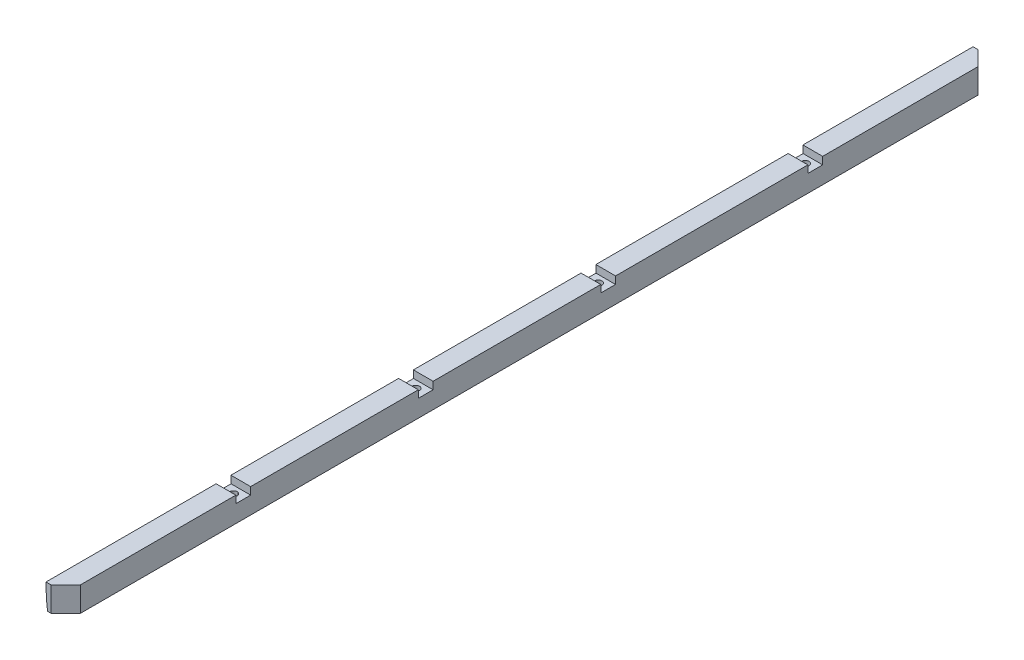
ISO-10303-21;
HEADER;
FILE_DESCRIPTION(('STEP AP214'),'2;1');
FILE_NAME('part.step','',(''),(''),'','','');
FILE_SCHEMA(('AUTOMOTIVE_DESIGN { 1 0 10303 214 1 1 1 1 }'));
ENDSEC;
DATA;
#1=APPLICATION_CONTEXT('core data for automotive mechanical design processes');
#2=APPLICATION_PROTOCOL_DEFINITION('international standard','automotive_design',2000,#1);
#3=PRODUCT_CONTEXT('',#1,'mechanical');
#4=PRODUCT('Part','Part','',(#3));
#5=PRODUCT_RELATED_PRODUCT_CATEGORY('part','',(#4));
#6=PRODUCT_DEFINITION_FORMATION('','',#4);
#7=PRODUCT_DEFINITION_CONTEXT('part definition',#1,'design');
#8=PRODUCT_DEFINITION('design','',#6,#7);
#9=PRODUCT_DEFINITION_SHAPE('','',#8);
#10=(LENGTH_UNIT() NAMED_UNIT(*) SI_UNIT(.MILLI.,.METRE.));
#11=(NAMED_UNIT(*) PLANE_ANGLE_UNIT() SI_UNIT($,.RADIAN.));
#12=(NAMED_UNIT(*) SI_UNIT($,.STERADIAN.) SOLID_ANGLE_UNIT());
#13=UNCERTAINTY_MEASURE_WITH_UNIT(LENGTH_MEASURE(1.E-05),#10,'distance_accuracy_value','');
#14=(GEOMETRIC_REPRESENTATION_CONTEXT(3) GLOBAL_UNCERTAINTY_ASSIGNED_CONTEXT((#13)) GLOBAL_UNIT_ASSIGNED_CONTEXT((#10,
#11,#12)) REPRESENTATION_CONTEXT('',''));
#15=CARTESIAN_POINT('',(0.,0.,0.));
#16=DIRECTION('',(0.,0.,1.));
#17=DIRECTION('',(1.,0.,0.));
#18=AXIS2_PLACEMENT_3D('',#15,#16,#17);
#19=CARTESIAN_POINT('',(234.95,0.,1193.8));
#20=DIRECTION('',(0.,-1.,0.));
#21=DIRECTION('',(0.,0.,-1.));
#22=AXIS2_PLACEMENT_3D('',#19,#20,#21);
#23=PLANE('',#22);
#24=DIRECTION('',(0.,0.,-1.));
#25=VECTOR('',#24,1.);
#26=CARTESIAN_POINT('',(234.95,0.,1193.8));
#27=LINE('',#26,#25);
#28=CARTESIAN_POINT('',(234.95,0.,1174.75));
#29=VERTEX_POINT('',#28);
#30=CARTESIAN_POINT('',(234.95,0.,974.725));
#31=VERTEX_POINT('',#30);
#32=EDGE_CURVE('E212',#29,#31,#27,.T.);
#33=ORIENTED_EDGE('',*,*,#32,.T.);
#34=DIRECTION('',(-1.,0.,0.));
#35=VECTOR('',#34,1.);
#36=CARTESIAN_POINT('',(117.502238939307,0.,974.725));
#37=LINE('',#36,#35);
#38=CARTESIAN_POINT('',(209.55,0.,974.725));
#39=VERTEX_POINT('',#38);
#40=EDGE_CURVE('E271',#31,#39,#37,.T.);
#41=ORIENTED_EDGE('',*,*,#40,.T.);
#42=DIRECTION('',(0.,0.,-1.));
#43=VECTOR('',#42,1.);
#44=CARTESIAN_POINT('',(209.55,0.,1193.8));
#45=LINE('',#44,#43);
#46=CARTESIAN_POINT('',(209.55,0.,1193.8));
#47=VERTEX_POINT('',#46);
#48=EDGE_CURVE('E223',#47,#39,#45,.T.);
#49=ORIENTED_EDGE('',*,*,#48,.F.);
#50=DIRECTION('',(1.,0.,0.));
#51=VECTOR('',#50,1.);
#52=CARTESIAN_POINT('',(234.95,0.,1193.8));
#53=LINE('',#52,#51);
#54=CARTESIAN_POINT('',(215.9,0.,1193.8));
#55=VERTEX_POINT('',#54);
#56=EDGE_CURVE('E208',#47,#55,#53,.T.);
#57=ORIENTED_EDGE('',*,*,#56,.T.);
#58=DIRECTION('',(0.707106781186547,0.,-0.707106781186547));
#59=VECTOR('',#58,1.);
#60=CARTESIAN_POINT('',(215.9,0.,1193.8));
#61=LINE('',#60,#59);
#62=EDGE_CURVE('E339',#55,#29,#61,.T.);
#63=ORIENTED_EDGE('',*,*,#62,.T.);
#64=EDGE_LOOP('',(#33,#41,#49,#57,#63));
#65=FACE_BOUND('',#64,.T.);
#66=ADVANCED_FACE('F37',(#65),#23,.F.);
#67=CARTESIAN_POINT('',(234.95,0.,955.675));
#68=VERTEX_POINT('',#67);
#69=CARTESIAN_POINT('',(234.95,0.,739.775));
#70=VERTEX_POINT('',#69);
#71=EDGE_CURVE('E222',#68,#70,#27,.T.);
#72=ORIENTED_EDGE('',*,*,#71,.T.);
#73=DIRECTION('',(-1.,0.,0.));
#74=VECTOR('',#73,1.);
#75=CARTESIAN_POINT('',(117.502238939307,0.,739.775));
#76=LINE('',#75,#74);
#77=CARTESIAN_POINT('',(209.55,0.,739.775));
#78=VERTEX_POINT('',#77);
#79=EDGE_CURVE('E363',#70,#78,#76,.T.);
#80=ORIENTED_EDGE('',*,*,#79,.T.);
#81=CARTESIAN_POINT('',(209.55,0.,955.675));
#82=VERTEX_POINT('',#81);
#83=EDGE_CURVE('E227',#82,#78,#45,.T.);
#84=ORIENTED_EDGE('',*,*,#83,.F.);
#85=DIRECTION('',(1.,0.,0.));
#86=VECTOR('',#85,1.);
#87=CARTESIAN_POINT('',(117.502238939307,0.,955.675));
#88=LINE('',#87,#86);
#89=EDGE_CURVE('E261',#82,#68,#88,.T.);
#90=ORIENTED_EDGE('',*,*,#89,.T.);
#91=EDGE_LOOP('',(#72,#80,#84,#90));
#92=FACE_BOUND('',#91,.T.);
#93=ADVANCED_FACE('F268',(#92),#23,.F.);
#94=CARTESIAN_POINT('',(234.95,0.,720.725));
#95=VERTEX_POINT('',#94);
#96=CARTESIAN_POINT('',(234.95,0.,504.825));
#97=VERTEX_POINT('',#96);
#98=EDGE_CURVE('E275',#95,#97,#27,.T.);
#99=ORIENTED_EDGE('',*,*,#98,.T.);
#100=DIRECTION('',(-1.,0.,0.));
#101=VECTOR('',#100,1.);
#102=CARTESIAN_POINT('',(117.502238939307,0.,504.825));
#103=LINE('',#102,#101);
#104=CARTESIAN_POINT('',(209.55,0.,504.825));
#105=VERTEX_POINT('',#104);
#106=EDGE_CURVE('E378',#97,#105,#103,.T.);
#107=ORIENTED_EDGE('',*,*,#106,.T.);
#108=CARTESIAN_POINT('',(209.55,0.,720.725));
#109=VERTEX_POINT('',#108);
#110=EDGE_CURVE('E395',#109,#105,#45,.T.);
#111=ORIENTED_EDGE('',*,*,#110,.F.);
#112=DIRECTION('',(1.,0.,0.));
#113=VECTOR('',#112,1.);
#114=CARTESIAN_POINT('',(117.502238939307,0.,720.725));
#115=LINE('',#114,#113);
#116=EDGE_CURVE('E359',#109,#95,#115,.T.);
#117=ORIENTED_EDGE('',*,*,#116,.T.);
#118=EDGE_LOOP('',(#99,#107,#111,#117));
#119=FACE_BOUND('',#118,.T.);
#120=ADVANCED_FACE('F417',(#119),#23,.F.);
#121=CARTESIAN_POINT('',(234.95,0.,485.775));
#122=VERTEX_POINT('',#121);
#123=CARTESIAN_POINT('',(234.95,0.,238.125));
#124=VERTEX_POINT('',#123);
#125=EDGE_CURVE('E210',#122,#124,#27,.T.);
#126=ORIENTED_EDGE('',*,*,#125,.T.);
#127=DIRECTION('',(-1.,0.,0.));
#128=VECTOR('',#127,1.);
#129=CARTESIAN_POINT('',(117.502238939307,0.,238.125));
#130=LINE('',#129,#128);
#131=CARTESIAN_POINT('',(209.55,0.,238.125));
#132=VERTEX_POINT('',#131);
#133=EDGE_CURVE('E289',#124,#132,#130,.T.);
#134=ORIENTED_EDGE('',*,*,#133,.T.);
#135=CARTESIAN_POINT('',(209.55,0.,485.775));
#136=VERTEX_POINT('',#135);
#137=EDGE_CURVE('E393',#136,#132,#45,.T.);
#138=ORIENTED_EDGE('',*,*,#137,.F.);
#139=DIRECTION('',(1.,0.,0.));
#140=VECTOR('',#139,1.);
#141=CARTESIAN_POINT('',(117.502238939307,0.,485.775));
#142=LINE('',#141,#140);
#143=EDGE_CURVE('E291',#136,#122,#142,.T.);
#144=ORIENTED_EDGE('',*,*,#143,.T.);
#145=EDGE_LOOP('',(#126,#134,#138,#144));
#146=FACE_BOUND('',#145,.T.);
#147=ADVANCED_FACE('F286',(#146),#23,.F.);
#148=CARTESIAN_POINT('',(234.95,-31.75,1193.8));
#149=DIRECTION('',(0.,1.,0.));
#150=DIRECTION('',(1.,0.,0.));
#151=AXIS2_PLACEMENT_3D('',#148,#149,#150);
#152=PLANE('',#151);
#153=CARTESIAN_POINT('',(222.25,-31.7500000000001,228.6));
#154=DIRECTION('',(0.,-1.,0.));
#155=DIRECTION('',(0.,0.,1.));
#156=AXIS2_PLACEMENT_3D('',#153,#154,#155);
#157=CIRCLE('',#156,4.76250000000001);
#158=CARTESIAN_POINT('',(222.25,-31.7500000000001,233.3625));
#159=VERTEX_POINT('',#158);
#160=EDGE_CURVE('E646',#159,#159,#157,.T.);
#161=ORIENTED_EDGE('',*,*,#160,.F.);
#162=EDGE_LOOP('',(#161));
#163=FACE_BOUND('',#162,.T.);
#164=CARTESIAN_POINT('',(222.25,-31.7500000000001,495.3));
#165=DIRECTION('',(0.,-1.,0.));
#166=DIRECTION('',(0.,0.,1.));
#167=AXIS2_PLACEMENT_3D('',#164,#165,#166);
#168=CIRCLE('',#167,4.76250000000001);
#169=CARTESIAN_POINT('',(222.25,-31.7500000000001,500.0625));
#170=VERTEX_POINT('',#169);
#171=EDGE_CURVE('E654',#170,#170,#168,.T.);
#172=ORIENTED_EDGE('',*,*,#171,.F.);
#173=EDGE_LOOP('',(#172));
#174=FACE_BOUND('',#173,.T.);
#175=CARTESIAN_POINT('',(222.25,-31.7500000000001,730.25));
#176=DIRECTION('',(0.,-1.,0.));
#177=DIRECTION('',(0.,0.,1.));
#178=AXIS2_PLACEMENT_3D('',#175,#176,#177);
#179=CIRCLE('',#178,4.76250000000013);
#180=CARTESIAN_POINT('',(222.25,-31.7500000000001,735.0125));
#181=VERTEX_POINT('',#180);
#182=EDGE_CURVE('E660',#181,#181,#179,.T.);
#183=ORIENTED_EDGE('',*,*,#182,.F.);
#184=EDGE_LOOP('',(#183));
#185=FACE_BOUND('',#184,.T.);
#186=CARTESIAN_POINT('',(222.424296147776,-31.7500000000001,965.2));
#187=DIRECTION('',(0.,-1.,0.));
#188=DIRECTION('',(0.,0.,1.));
#189=AXIS2_PLACEMENT_3D('',#186,#187,#188);
#190=CIRCLE('',#189,4.76250000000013);
#191=CARTESIAN_POINT('',(222.424296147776,-31.7500000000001,969.9625));
#192=VERTEX_POINT('',#191);
#193=EDGE_CURVE('E332',#192,#192,#190,.T.);
#194=ORIENTED_EDGE('',*,*,#193,.F.);
#195=EDGE_LOOP('',(#194));
#196=FACE_BOUND('',#195,.T.);
#197=DIRECTION('',(0.,0.,-1.));
#198=VECTOR('',#197,1.);
#199=CARTESIAN_POINT('',(234.95,-31.75,1193.8));
#200=LINE('',#199,#198);
#201=CARTESIAN_POINT('',(234.95,-31.7500000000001,1174.75));
#202=VERTEX_POINT('',#201);
#203=CARTESIAN_POINT('',(234.95,-31.7500000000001,19.05));
#204=VERTEX_POINT('',#203);
#205=EDGE_CURVE('E199',#202,#204,#200,.T.);
#206=ORIENTED_EDGE('',*,*,#205,.F.);
#207=DIRECTION('',(0.707106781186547,0.,-0.707106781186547));
#208=VECTOR('',#207,1.);
#209=CARTESIAN_POINT('',(215.9,-31.7500000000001,1193.8));
#210=LINE('',#209,#208);
#211=CARTESIAN_POINT('',(215.9,-31.75,1193.8));
#212=VERTEX_POINT('',#211);
#213=EDGE_CURVE('E341',#212,#202,#210,.T.);
#214=ORIENTED_EDGE('',*,*,#213,.F.);
#215=DIRECTION('',(-1.,0.,0.));
#216=VECTOR('',#215,1.);
#217=CARTESIAN_POINT('',(234.95,-31.75,1193.8));
#218=LINE('',#217,#216);
#219=CARTESIAN_POINT('',(211.493227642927,-31.7500000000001,1193.8));
#220=VERTEX_POINT('',#219);
#221=EDGE_CURVE('E318',#212,#220,#218,.T.);
#222=ORIENTED_EDGE('',*,*,#221,.T.);
#223=DIRECTION('',(0.,0.,-1.));
#224=VECTOR('',#223,1.);
#225=CARTESIAN_POINT('',(211.493227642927,-31.7500000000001,1193.8));
#226=LINE('',#225,#224);
#227=CARTESIAN_POINT('',(211.493227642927,-31.7500000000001,0.));
#228=VERTEX_POINT('',#227);
#229=EDGE_CURVE('E226',#220,#228,#226,.T.);
#230=ORIENTED_EDGE('',*,*,#229,.T.);
#231=DIRECTION('',(-1.,0.,0.));
#232=VECTOR('',#231,1.);
#233=CARTESIAN_POINT('',(234.95,-31.75,0.));
#234=LINE('',#233,#232);
#235=CARTESIAN_POINT('',(215.9,-31.7500000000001,0.));
#236=VERTEX_POINT('',#235);
#237=EDGE_CURVE('E202',#236,#228,#234,.T.);
#238=ORIENTED_EDGE('',*,*,#237,.F.);
#239=DIRECTION('',(-0.707106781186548,0.,-0.707106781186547));
#240=VECTOR('',#239,1.);
#241=CARTESIAN_POINT('',(215.9,-31.7500000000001,0.));
#242=LINE('',#241,#240);
#243=EDGE_CURVE('E188',#204,#236,#242,.T.);
#244=ORIENTED_EDGE('',*,*,#243,.F.);
#245=EDGE_LOOP('',(#206,#214,#222,#230,#238,#244));
#246=FACE_BOUND('',#245,.T.);
#247=ADVANCED_FACE('F39',(#163,#174,#185,#196,#246),#152,.F.);
#248=CARTESIAN_POINT('',(469.9,0.,1193.8));
#249=DIRECTION('',(0.,0.,-1.));
#250=DIRECTION('',(1.,0.,0.));
#251=AXIS2_PLACEMENT_3D('',#248,#249,#250);
#252=CYLINDRICAL_SURFACE('',#251,260.35);
#253=DIRECTION('',(0.,0.,-1.));
#254=VECTOR('',#253,1.);
#255=CARTESIAN_POINT('',(209.724296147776,-9.525,1193.8));
#256=LINE('',#255,#254);
#257=CARTESIAN_POINT('',(209.724296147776,-9.525,974.725));
#258=VERTEX_POINT('',#257);
#259=CARTESIAN_POINT('',(209.724296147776,-9.525,955.675));
#260=VERTEX_POINT('',#259);
#261=EDGE_CURVE('E349',#258,#260,#256,.T.);
#262=ORIENTED_EDGE('',*,*,#261,.T.);
#263=CARTESIAN_POINT('',(469.9,0.,955.675));
#264=DIRECTION('',(0.,0.,1.));
#265=DIRECTION('',(1.,0.,0.));
#266=AXIS2_PLACEMENT_3D('',#263,#264,#265);
#267=CIRCLE('',#266,260.35);
#268=EDGE_CURVE('E355',#82,#260,#267,.T.);
#269=ORIENTED_EDGE('',*,*,#268,.F.);
#270=ORIENTED_EDGE('',*,*,#83,.T.);
#271=CARTESIAN_POINT('',(469.9,0.,739.775));
#272=DIRECTION('',(0.,0.,-1.));
#273=DIRECTION('',(-1.,0.,0.));
#274=AXIS2_PLACEMENT_3D('',#271,#272,#273);
#275=CIRCLE('',#274,260.35);
#276=CARTESIAN_POINT('',(209.724296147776,-9.525,739.775));
#277=VERTEX_POINT('',#276);
#278=EDGE_CURVE('E373',#277,#78,#275,.T.);
#279=ORIENTED_EDGE('',*,*,#278,.F.);
#280=DIRECTION('',(0.,0.,-1.));
#281=VECTOR('',#280,1.);
#282=CARTESIAN_POINT('',(209.724296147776,-9.525,1193.8));
#283=LINE('',#282,#281);
#284=CARTESIAN_POINT('',(209.724296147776,-9.525,720.725));
#285=VERTEX_POINT('',#284);
#286=EDGE_CURVE('E365',#285,#277,#283,.F.);
#287=ORIENTED_EDGE('',*,*,#286,.F.);
#288=CARTESIAN_POINT('',(469.9,0.,720.725));
#289=DIRECTION('',(0.,0.,1.));
#290=DIRECTION('',(1.,0.,0.));
#291=AXIS2_PLACEMENT_3D('',#288,#289,#290);
#292=CIRCLE('',#291,260.35);
#293=EDGE_CURVE('E370',#109,#285,#292,.T.);
#294=ORIENTED_EDGE('',*,*,#293,.F.);
#295=ORIENTED_EDGE('',*,*,#110,.T.);
#296=CARTESIAN_POINT('',(469.9,0.,504.825));
#297=DIRECTION('',(0.,0.,-1.));
#298=DIRECTION('',(-1.,0.,0.));
#299=AXIS2_PLACEMENT_3D('',#296,#297,#298);
#300=CIRCLE('',#299,260.35);
#301=CARTESIAN_POINT('',(209.724296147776,-9.525,504.825));
#302=VERTEX_POINT('',#301);
#303=EDGE_CURVE('E307',#302,#105,#300,.T.);
#304=ORIENTED_EDGE('',*,*,#303,.F.);
#305=DIRECTION('',(0.,0.,-1.));
#306=VECTOR('',#305,1.);
#307=CARTESIAN_POINT('',(209.724296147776,-9.525,1193.8));
#308=LINE('',#307,#306);
#309=CARTESIAN_POINT('',(209.724296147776,-9.525,485.775));
#310=VERTEX_POINT('',#309);
#311=EDGE_CURVE('E380',#310,#302,#308,.F.);
#312=ORIENTED_EDGE('',*,*,#311,.F.);
#313=CARTESIAN_POINT('',(469.9,0.,485.775));
#314=DIRECTION('',(0.,0.,1.));
#315=DIRECTION('',(1.,0.,0.));
#316=AXIS2_PLACEMENT_3D('',#313,#314,#315);
#317=CIRCLE('',#316,260.35);
#318=EDGE_CURVE('E385',#136,#310,#317,.T.);
#319=ORIENTED_EDGE('',*,*,#318,.F.);
#320=ORIENTED_EDGE('',*,*,#137,.T.);
#321=CARTESIAN_POINT('',(469.9,0.,238.125));
#322=DIRECTION('',(0.,0.,-1.));
#323=DIRECTION('',(-1.,0.,0.));
#324=AXIS2_PLACEMENT_3D('',#321,#322,#323);
#325=CIRCLE('',#324,260.35);
#326=CARTESIAN_POINT('',(209.724296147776,-9.525,238.125));
#327=VERTEX_POINT('',#326);
#328=EDGE_CURVE('E299',#327,#132,#325,.T.);
#329=ORIENTED_EDGE('',*,*,#328,.F.);
#330=DIRECTION('',(0.,0.,-1.));
#331=VECTOR('',#330,1.);
#332=CARTESIAN_POINT('',(209.724296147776,-9.525,1193.8));
#333=LINE('',#332,#331);
#334=CARTESIAN_POINT('',(209.724296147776,-9.525,219.075));
#335=VERTEX_POINT('',#334);
#336=EDGE_CURVE('E311',#335,#327,#333,.F.);
#337=ORIENTED_EDGE('',*,*,#336,.F.);
#338=CARTESIAN_POINT('',(469.9,0.,219.075));
#339=DIRECTION('',(0.,0.,1.));
#340=DIRECTION('',(1.,0.,0.));
#341=AXIS2_PLACEMENT_3D('',#338,#339,#340);
#342=CIRCLE('',#341,260.35);
#343=CARTESIAN_POINT('',(209.55,0.,219.075));
#344=VERTEX_POINT('',#343);
#345=EDGE_CURVE('E314',#344,#335,#342,.T.);
#346=ORIENTED_EDGE('',*,*,#345,.F.);
#347=CARTESIAN_POINT('',(209.55,0.,0.));
#348=VERTEX_POINT('',#347);
#349=EDGE_CURVE('E221',#344,#348,#45,.T.);
#350=ORIENTED_EDGE('',*,*,#349,.T.);
#351=CARTESIAN_POINT('',(469.9,0.,0.));
#352=DIRECTION('',(0.,0.,-1.));
#353=DIRECTION('',(-1.,0.,0.));
#354=AXIS2_PLACEMENT_3D('',#351,#352,#353);
#355=CIRCLE('',#354,260.35);
#356=EDGE_CURVE('E322',#228,#348,#355,.T.);
#357=ORIENTED_EDGE('',*,*,#356,.F.);
#358=ORIENTED_EDGE('',*,*,#229,.F.);
#359=CARTESIAN_POINT('',(469.9,0.,1193.8));
#360=DIRECTION('',(0.,0.,-1.));
#361=DIRECTION('',(-1.,0.,0.));
#362=AXIS2_PLACEMENT_3D('',#359,#360,#361);
#363=CIRCLE('',#362,260.35);
#364=EDGE_CURVE('E214',#220,#47,#363,.T.);
#365=ORIENTED_EDGE('',*,*,#364,.T.);
#366=ORIENTED_EDGE('',*,*,#48,.T.);
#367=CARTESIAN_POINT('',(469.9,0.,974.725));
#368=DIRECTION('',(0.,0.,-1.));
#369=DIRECTION('',(-1.,0.,0.));
#370=AXIS2_PLACEMENT_3D('',#367,#368,#369);
#371=CIRCLE('',#370,260.35);
#372=EDGE_CURVE('E357',#258,#39,#371,.T.);
#373=ORIENTED_EDGE('',*,*,#372,.F.);
#374=EDGE_LOOP('',(#262,#269,#270,#279,#287,#294,#295,#304,#312,#319,#320,#329,#337,#346,#350,
#357,#358,#365,#366,#373));
#375=FACE_BOUND('',#374,.T.);
#376=ADVANCED_FACE('F392',(#375),#252,.T.);
#377=DIRECTION('',(1.,0.,0.));
#378=VECTOR('',#377,1.);
#379=CARTESIAN_POINT('',(234.95,0.,0.));
#380=LINE('',#379,#378);
#381=CARTESIAN_POINT('',(215.9,0.,0.));
#382=VERTEX_POINT('',#381);
#383=EDGE_CURVE('E217',#348,#382,#380,.T.);
#384=ORIENTED_EDGE('',*,*,#383,.F.);
#385=ORIENTED_EDGE('',*,*,#349,.F.);
#386=DIRECTION('',(1.,0.,0.));
#387=VECTOR('',#386,1.);
#388=CARTESIAN_POINT('',(117.502238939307,0.,219.075));
#389=LINE('',#388,#387);
#390=CARTESIAN_POINT('',(234.95,0.,219.075));
#391=VERTEX_POINT('',#390);
#392=EDGE_CURVE('E302',#344,#391,#389,.T.);
#393=ORIENTED_EDGE('',*,*,#392,.T.);
#394=CARTESIAN_POINT('',(234.95,0.,19.05));
#395=VERTEX_POINT('',#394);
#396=EDGE_CURVE('E207',#391,#395,#27,.T.);
#397=ORIENTED_EDGE('',*,*,#396,.T.);
#398=DIRECTION('',(-0.707106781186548,0.,-0.707106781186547));
#399=VECTOR('',#398,1.);
#400=CARTESIAN_POINT('',(215.9,0.,0.));
#401=LINE('',#400,#399);
#402=EDGE_CURVE('E190',#395,#382,#401,.T.);
#403=ORIENTED_EDGE('',*,*,#402,.T.);
#404=EDGE_LOOP('',(#384,#385,#393,#397,#403));
#405=FACE_BOUND('',#404,.T.);
#406=ADVANCED_FACE('F330',(#405),#23,.F.);
#407=CARTESIAN_POINT('',(234.95,0.,1193.8));
#408=DIRECTION('',(-1.,0.,0.));
#409=DIRECTION('',(0.,0.,-1.));
#410=AXIS2_PLACEMENT_3D('',#407,#408,#409);
#411=PLANE('',#410);
#412=ORIENTED_EDGE('',*,*,#396,.F.);
#413=DIRECTION('',(0.,1.,0.));
#414=VECTOR('',#413,1.);
#415=CARTESIAN_POINT('',(234.95,0.,219.075));
#416=LINE('',#415,#414);
#417=CARTESIAN_POINT('',(234.95,-9.525,219.075));
#418=VERTEX_POINT('',#417);
#419=EDGE_CURVE('E232',#418,#391,#416,.T.);
#420=ORIENTED_EDGE('',*,*,#419,.F.);
#421=DIRECTION('',(0.,0.,-1.));
#422=VECTOR('',#421,1.);
#423=CARTESIAN_POINT('',(234.95,-9.525,1193.8));
#424=LINE('',#423,#422);
#425=CARTESIAN_POINT('',(234.95,-9.525,238.125));
#426=VERTEX_POINT('',#425);
#427=EDGE_CURVE('E229',#426,#418,#424,.T.);
#428=ORIENTED_EDGE('',*,*,#427,.F.);
#429=DIRECTION('',(0.,-1.,0.));
#430=VECTOR('',#429,1.);
#431=CARTESIAN_POINT('',(234.95,0.,238.125));
#432=LINE('',#431,#430);
#433=EDGE_CURVE('E234',#124,#426,#432,.T.);
#434=ORIENTED_EDGE('',*,*,#433,.F.);
#435=ORIENTED_EDGE('',*,*,#125,.F.);
#436=DIRECTION('',(0.,1.,0.));
#437=VECTOR('',#436,1.);
#438=CARTESIAN_POINT('',(234.95,0.,485.775));
#439=LINE('',#438,#437);
#440=CARTESIAN_POINT('',(234.95,-9.525,485.775));
#441=VERTEX_POINT('',#440);
#442=EDGE_CURVE('E240',#441,#122,#439,.T.);
#443=ORIENTED_EDGE('',*,*,#442,.F.);
#444=DIRECTION('',(0.,0.,-1.));
#445=VECTOR('',#444,1.);
#446=CARTESIAN_POINT('',(234.95,-9.525,1193.8));
#447=LINE('',#446,#445);
#448=CARTESIAN_POINT('',(234.95,-9.525,504.825));
#449=VERTEX_POINT('',#448);
#450=EDGE_CURVE('E237',#449,#441,#447,.T.);
#451=ORIENTED_EDGE('',*,*,#450,.F.);
#452=DIRECTION('',(0.,-1.,0.));
#453=VECTOR('',#452,1.);
#454=CARTESIAN_POINT('',(234.95,0.,504.825));
#455=LINE('',#454,#453);
#456=EDGE_CURVE('E242',#97,#449,#455,.T.);
#457=ORIENTED_EDGE('',*,*,#456,.F.);
#458=ORIENTED_EDGE('',*,*,#98,.F.);
#459=DIRECTION('',(0.,1.,0.));
#460=VECTOR('',#459,1.);
#461=CARTESIAN_POINT('',(234.95,0.,720.725));
#462=LINE('',#461,#460);
#463=CARTESIAN_POINT('',(234.95,-9.525,720.725));
#464=VERTEX_POINT('',#463);
#465=EDGE_CURVE('E248',#464,#95,#462,.T.);
#466=ORIENTED_EDGE('',*,*,#465,.F.);
#467=DIRECTION('',(0.,0.,-1.));
#468=VECTOR('',#467,1.);
#469=CARTESIAN_POINT('',(234.95,-9.525,1193.8));
#470=LINE('',#469,#468);
#471=CARTESIAN_POINT('',(234.95,-9.525,739.775));
#472=VERTEX_POINT('',#471);
#473=EDGE_CURVE('E245',#472,#464,#470,.T.);
#474=ORIENTED_EDGE('',*,*,#473,.F.);
#475=DIRECTION('',(0.,-1.,0.));
#476=VECTOR('',#475,1.);
#477=CARTESIAN_POINT('',(234.95,0.,739.775));
#478=LINE('',#477,#476);
#479=EDGE_CURVE('E250',#70,#472,#478,.T.);
#480=ORIENTED_EDGE('',*,*,#479,.F.);
#481=ORIENTED_EDGE('',*,*,#71,.F.);
#482=DIRECTION('',(0.,1.,0.));
#483=VECTOR('',#482,1.);
#484=CARTESIAN_POINT('',(234.95,0.,955.675));
#485=LINE('',#484,#483);
#486=CARTESIAN_POINT('',(234.95,-9.525,955.675));
#487=VERTEX_POINT('',#486);
#488=EDGE_CURVE('E45',#487,#68,#485,.T.);
#489=ORIENTED_EDGE('',*,*,#488,.F.);
#490=DIRECTION('',(0.,0.,1.));
#491=VECTOR('',#490,1.);
#492=CARTESIAN_POINT('',(234.95,-9.525,1193.8));
#493=LINE('',#492,#491);
#494=CARTESIAN_POINT('',(234.95,-9.525,974.725));
#495=VERTEX_POINT('',#494);
#496=EDGE_CURVE('E253',#487,#495,#493,.T.);
#497=ORIENTED_EDGE('',*,*,#496,.T.);
#498=DIRECTION('',(0.,-1.,0.));
#499=VECTOR('',#498,1.);
#500=CARTESIAN_POINT('',(234.95,0.,974.725));
#501=LINE('',#500,#499);
#502=EDGE_CURVE('E11',#31,#495,#501,.T.);
#503=ORIENTED_EDGE('',*,*,#502,.F.);
#504=ORIENTED_EDGE('',*,*,#32,.F.);
#505=DIRECTION('',(0.,1.,0.));
#506=VECTOR('',#505,1.);
#507=CARTESIAN_POINT('',(234.95,-31.7500000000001,1174.75));
#508=LINE('',#507,#506);
#509=EDGE_CURVE('E206',#202,#29,#508,.T.);
#510=ORIENTED_EDGE('',*,*,#509,.F.);
#511=ORIENTED_EDGE('',*,*,#205,.T.);
#512=DIRECTION('',(0.,1.,0.));
#513=VECTOR('',#512,1.);
#514=CARTESIAN_POINT('',(234.95,-31.7500000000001,19.05));
#515=LINE('',#514,#513);
#516=EDGE_CURVE('E185',#204,#395,#515,.T.);
#517=ORIENTED_EDGE('',*,*,#516,.T.);
#518=EDGE_LOOP('',(#412,#420,#428,#434,#435,#443,#451,#457,#458,#466,#474,#480,#481,#489,#497,
#503,#504,#510,#511,#517));
#519=FACE_BOUND('',#518,.T.);
#520=ADVANCED_FACE('F204',(#519),#411,.F.);
#521=CARTESIAN_POINT('',(469.9,0.,1193.8));
#522=DIRECTION('',(0.,0.,1.));
#523=DIRECTION('',(-1.,0.,0.));
#524=AXIS2_PLACEMENT_3D('',#521,#522,#523);
#525=PLANE('',#524);
#526=DIRECTION('',(0.,1.,0.));
#527=VECTOR('',#526,1.);
#528=CARTESIAN_POINT('',(215.9,-31.7500000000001,1193.8));
#529=LINE('',#528,#527);
#530=EDGE_CURVE('E60',#212,#55,#529,.T.);
#531=ORIENTED_EDGE('',*,*,#530,.T.);
#532=ORIENTED_EDGE('',*,*,#56,.F.);
#533=ORIENTED_EDGE('',*,*,#364,.F.);
#534=ORIENTED_EDGE('',*,*,#221,.F.);
#535=EDGE_LOOP('',(#531,#532,#533,#534));
#536=FACE_BOUND('',#535,.T.);
#537=ADVANCED_FACE('F424',(#536),#525,.T.);
#538=CARTESIAN_POINT('',(469.9,0.,0.));
#539=DIRECTION('',(0.,0.,1.));
#540=DIRECTION('',(-1.,0.,0.));
#541=AXIS2_PLACEMENT_3D('',#538,#539,#540);
#542=PLANE('',#541);
#543=ORIENTED_EDGE('',*,*,#237,.T.);
#544=ORIENTED_EDGE('',*,*,#356,.T.);
#545=ORIENTED_EDGE('',*,*,#383,.T.);
#546=DIRECTION('',(0.,1.,0.));
#547=VECTOR('',#546,1.);
#548=CARTESIAN_POINT('',(215.9,-31.7500000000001,0.));
#549=LINE('',#548,#547);
#550=EDGE_CURVE('E52',#236,#382,#549,.T.);
#551=ORIENTED_EDGE('',*,*,#550,.F.);
#552=EDGE_LOOP('',(#543,#544,#545,#551));
#553=FACE_BOUND('',#552,.T.);
#554=ADVANCED_FACE('F327',(#553),#542,.F.);
#555=CARTESIAN_POINT('',(117.502238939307,-9.525,238.125));
#556=DIRECTION('',(0.,0.,1.));
#557=DIRECTION('',(-1.,0.,0.));
#558=AXIS2_PLACEMENT_3D('',#555,#556,#557);
#559=PLANE('',#558);
#560=DIRECTION('',(-1.,0.,0.));
#561=VECTOR('',#560,1.);
#562=CARTESIAN_POINT('',(117.502238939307,-9.525,238.125));
#563=LINE('',#562,#561);
#564=EDGE_CURVE('E304',#426,#327,#563,.T.);
#565=ORIENTED_EDGE('',*,*,#564,.T.);
#566=ORIENTED_EDGE('',*,*,#328,.T.);
#567=ORIENTED_EDGE('',*,*,#133,.F.);
#568=ORIENTED_EDGE('',*,*,#433,.T.);
#569=EDGE_LOOP('',(#565,#566,#567,#568));
#570=FACE_BOUND('',#569,.T.);
#571=ADVANCED_FACE('F297',(#570),#559,.F.);
#572=CARTESIAN_POINT('',(117.502238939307,-9.525,219.075));
#573=DIRECTION('',(0.,0.,-1.));
#574=DIRECTION('',(1.,0.,0.));
#575=AXIS2_PLACEMENT_3D('',#572,#573,#574);
#576=PLANE('',#575);
#577=ORIENTED_EDGE('',*,*,#392,.F.);
#578=ORIENTED_EDGE('',*,*,#345,.T.);
#579=DIRECTION('',(1.,0.,0.));
#580=VECTOR('',#579,1.);
#581=CARTESIAN_POINT('',(117.502238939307,-9.525,219.075));
#582=LINE('',#581,#580);
#583=EDGE_CURVE('E301',#335,#418,#582,.T.);
#584=ORIENTED_EDGE('',*,*,#583,.T.);
#585=ORIENTED_EDGE('',*,*,#419,.T.);
#586=EDGE_LOOP('',(#577,#578,#584,#585));
#587=FACE_BOUND('',#586,.T.);
#588=ADVANCED_FACE('F399',(#587),#576,.F.);
#589=CARTESIAN_POINT('',(117.502238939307,-9.525,238.125));
#590=DIRECTION('',(0.,-1.,0.));
#591=DIRECTION('',(0.,0.,-1.));
#592=AXIS2_PLACEMENT_3D('',#589,#590,#591);
#593=PLANE('',#592);
#594=CARTESIAN_POINT('',(222.25,-9.525,228.6));
#595=DIRECTION('',(0.,-1.,0.));
#596=DIRECTION('',(0.,0.,1.));
#597=AXIS2_PLACEMENT_3D('',#594,#595,#596);
#598=CIRCLE('',#597,4.76250000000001);
#599=CARTESIAN_POINT('',(222.25,-9.525,233.3625));
#600=VERTEX_POINT('',#599);
#601=EDGE_CURVE('E649',#600,#600,#598,.T.);
#602=ORIENTED_EDGE('',*,*,#601,.T.);
#603=EDGE_LOOP('',(#602));
#604=FACE_BOUND('',#603,.T.);
#605=ORIENTED_EDGE('',*,*,#583,.F.);
#606=ORIENTED_EDGE('',*,*,#336,.T.);
#607=ORIENTED_EDGE('',*,*,#564,.F.);
#608=ORIENTED_EDGE('',*,*,#427,.T.);
#609=EDGE_LOOP('',(#605,#606,#607,#608));
#610=FACE_BOUND('',#609,.T.);
#611=ADVANCED_FACE('F390',(#604,#610),#593,.F.);
#612=CARTESIAN_POINT('',(117.502238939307,-9.525,504.825));
#613=DIRECTION('',(0.,0.,1.));
#614=DIRECTION('',(-1.,0.,0.));
#615=AXIS2_PLACEMENT_3D('',#612,#613,#614);
#616=PLANE('',#615);
#617=DIRECTION('',(-1.,0.,0.));
#618=VECTOR('',#617,1.);
#619=CARTESIAN_POINT('',(117.502238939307,-9.525,504.825));
#620=LINE('',#619,#618);
#621=EDGE_CURVE('E377',#449,#302,#620,.T.);
#622=ORIENTED_EDGE('',*,*,#621,.T.);
#623=ORIENTED_EDGE('',*,*,#303,.T.);
#624=ORIENTED_EDGE('',*,*,#106,.F.);
#625=ORIENTED_EDGE('',*,*,#456,.T.);
#626=EDGE_LOOP('',(#622,#623,#624,#625));
#627=FACE_BOUND('',#626,.T.);
#628=ADVANCED_FACE('F406',(#627),#616,.F.);
#629=CARTESIAN_POINT('',(117.502238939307,-9.525,485.775));
#630=DIRECTION('',(0.,0.,-1.));
#631=DIRECTION('',(1.,0.,0.));
#632=AXIS2_PLACEMENT_3D('',#629,#630,#631);
#633=PLANE('',#632);
#634=ORIENTED_EDGE('',*,*,#143,.F.);
#635=ORIENTED_EDGE('',*,*,#318,.T.);
#636=DIRECTION('',(1.,0.,0.));
#637=VECTOR('',#636,1.);
#638=CARTESIAN_POINT('',(117.502238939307,-9.525,485.775));
#639=LINE('',#638,#637);
#640=EDGE_CURVE('E375',#310,#441,#639,.T.);
#641=ORIENTED_EDGE('',*,*,#640,.T.);
#642=ORIENTED_EDGE('',*,*,#442,.T.);
#643=EDGE_LOOP('',(#634,#635,#641,#642));
#644=FACE_BOUND('',#643,.T.);
#645=ADVANCED_FACE('F504',(#644),#633,.F.);
#646=CARTESIAN_POINT('',(117.502238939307,-9.525,504.825));
#647=DIRECTION('',(0.,-1.,0.));
#648=DIRECTION('',(0.,0.,-1.));
#649=AXIS2_PLACEMENT_3D('',#646,#647,#648);
#650=PLANE('',#649);
#651=CARTESIAN_POINT('',(222.25,-9.525,495.3));
#652=DIRECTION('',(0.,-1.,0.));
#653=DIRECTION('',(0.,0.,1.));
#654=AXIS2_PLACEMENT_3D('',#651,#652,#653);
#655=CIRCLE('',#654,4.76250000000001);
#656=CARTESIAN_POINT('',(222.25,-9.525,500.0625));
#657=VERTEX_POINT('',#656);
#658=EDGE_CURVE('E651',#657,#657,#655,.T.);
#659=ORIENTED_EDGE('',*,*,#658,.T.);
#660=EDGE_LOOP('',(#659));
#661=FACE_BOUND('',#660,.T.);
#662=ORIENTED_EDGE('',*,*,#640,.F.);
#663=ORIENTED_EDGE('',*,*,#311,.T.);
#664=ORIENTED_EDGE('',*,*,#621,.F.);
#665=ORIENTED_EDGE('',*,*,#450,.T.);
#666=EDGE_LOOP('',(#662,#663,#664,#665));
#667=FACE_BOUND('',#666,.T.);
#668=ADVANCED_FACE('F513',(#661,#667),#650,.F.);
#669=CARTESIAN_POINT('',(117.502238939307,-9.525,739.775));
#670=DIRECTION('',(0.,0.,1.));
#671=DIRECTION('',(-1.,0.,0.));
#672=AXIS2_PLACEMENT_3D('',#669,#670,#671);
#673=PLANE('',#672);
#674=DIRECTION('',(-1.,0.,0.));
#675=VECTOR('',#674,1.);
#676=CARTESIAN_POINT('',(117.502238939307,-9.525,739.775));
#677=LINE('',#676,#675);
#678=EDGE_CURVE('E362',#472,#277,#677,.T.);
#679=ORIENTED_EDGE('',*,*,#678,.T.);
#680=ORIENTED_EDGE('',*,*,#278,.T.);
#681=ORIENTED_EDGE('',*,*,#79,.F.);
#682=ORIENTED_EDGE('',*,*,#479,.T.);
#683=EDGE_LOOP('',(#679,#680,#681,#682));
#684=FACE_BOUND('',#683,.T.);
#685=ADVANCED_FACE('F522',(#684),#673,.F.);
#686=CARTESIAN_POINT('',(117.502238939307,-9.525,720.725));
#687=DIRECTION('',(0.,0.,-1.));
#688=DIRECTION('',(1.,0.,0.));
#689=AXIS2_PLACEMENT_3D('',#686,#687,#688);
#690=PLANE('',#689);
#691=ORIENTED_EDGE('',*,*,#116,.F.);
#692=ORIENTED_EDGE('',*,*,#293,.T.);
#693=DIRECTION('',(1.,0.,0.));
#694=VECTOR('',#693,1.);
#695=CARTESIAN_POINT('',(117.502238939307,-9.525,720.725));
#696=LINE('',#695,#694);
#697=EDGE_CURVE('E360',#285,#464,#696,.T.);
#698=ORIENTED_EDGE('',*,*,#697,.T.);
#699=ORIENTED_EDGE('',*,*,#465,.T.);
#700=EDGE_LOOP('',(#691,#692,#698,#699));
#701=FACE_BOUND('',#700,.T.);
#702=ADVANCED_FACE('F531',(#701),#690,.F.);
#703=CARTESIAN_POINT('',(117.502238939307,-9.525,739.775));
#704=DIRECTION('',(0.,-1.,0.));
#705=DIRECTION('',(0.,0.,-1.));
#706=AXIS2_PLACEMENT_3D('',#703,#704,#705);
#707=PLANE('',#706);
#708=CARTESIAN_POINT('',(222.25,-9.525,730.25));
#709=DIRECTION('',(0.,-1.,0.));
#710=DIRECTION('',(0.,0.,1.));
#711=AXIS2_PLACEMENT_3D('',#708,#709,#710);
#712=CIRCLE('',#711,4.76250000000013);
#713=CARTESIAN_POINT('',(222.25,-9.525,735.0125));
#714=VERTEX_POINT('',#713);
#715=EDGE_CURVE('E657',#714,#714,#712,.T.);
#716=ORIENTED_EDGE('',*,*,#715,.T.);
#717=EDGE_LOOP('',(#716));
#718=FACE_BOUND('',#717,.T.);
#719=ORIENTED_EDGE('',*,*,#697,.F.);
#720=ORIENTED_EDGE('',*,*,#286,.T.);
#721=ORIENTED_EDGE('',*,*,#678,.F.);
#722=ORIENTED_EDGE('',*,*,#473,.T.);
#723=EDGE_LOOP('',(#719,#720,#721,#722));
#724=FACE_BOUND('',#723,.T.);
#725=ADVANCED_FACE('F540',(#718,#724),#707,.F.);
#726=CARTESIAN_POINT('',(117.502238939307,-9.525,974.725));
#727=DIRECTION('',(0.,0.,1.));
#728=DIRECTION('',(-1.,0.,0.));
#729=AXIS2_PLACEMENT_3D('',#726,#727,#728);
#730=PLANE('',#729);
#731=DIRECTION('',(-1.,0.,0.));
#732=VECTOR('',#731,1.);
#733=CARTESIAN_POINT('',(117.502238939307,-9.525,974.725));
#734=LINE('',#733,#732);
#735=EDGE_CURVE('E348',#495,#258,#734,.T.);
#736=ORIENTED_EDGE('',*,*,#735,.T.);
#737=ORIENTED_EDGE('',*,*,#372,.T.);
#738=ORIENTED_EDGE('',*,*,#40,.F.);
#739=ORIENTED_EDGE('',*,*,#502,.T.);
#740=EDGE_LOOP('',(#736,#737,#738,#739));
#741=FACE_BOUND('',#740,.T.);
#742=ADVANCED_FACE('F549',(#741),#730,.F.);
#743=CARTESIAN_POINT('',(117.502238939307,-9.525,955.675));
#744=DIRECTION('',(0.,0.,-1.));
#745=DIRECTION('',(1.,0.,0.));
#746=AXIS2_PLACEMENT_3D('',#743,#744,#745);
#747=PLANE('',#746);
#748=ORIENTED_EDGE('',*,*,#89,.F.);
#749=ORIENTED_EDGE('',*,*,#268,.T.);
#750=DIRECTION('',(1.,0.,0.));
#751=VECTOR('',#750,1.);
#752=CARTESIAN_POINT('',(117.502238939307,-9.525,955.675));
#753=LINE('',#752,#751);
#754=EDGE_CURVE('E263',#260,#487,#753,.T.);
#755=ORIENTED_EDGE('',*,*,#754,.T.);
#756=ORIENTED_EDGE('',*,*,#488,.T.);
#757=EDGE_LOOP('',(#748,#749,#755,#756));
#758=FACE_BOUND('',#757,.T.);
#759=ADVANCED_FACE('F259',(#758),#747,.F.);
#760=CARTESIAN_POINT('',(117.502238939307,-9.525,955.675));
#761=DIRECTION('',(0.,1.,0.));
#762=DIRECTION('',(0.,0.,1.));
#763=AXIS2_PLACEMENT_3D('',#760,#761,#762);
#764=PLANE('',#763);
#765=CARTESIAN_POINT('',(222.424296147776,-9.525,965.2));
#766=DIRECTION('',(0.,-1.,0.));
#767=DIRECTION('',(0.,0.,1.));
#768=AXIS2_PLACEMENT_3D('',#765,#766,#767);
#769=CIRCLE('',#768,4.76250000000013);
#770=CARTESIAN_POINT('',(222.424296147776,-9.525,969.9625));
#771=VERTEX_POINT('',#770);
#772=EDGE_CURVE('E335',#771,#771,#769,.T.);
#773=ORIENTED_EDGE('',*,*,#772,.T.);
#774=EDGE_LOOP('',(#773));
#775=FACE_BOUND('',#774,.T.);
#776=ORIENTED_EDGE('',*,*,#261,.F.);
#777=ORIENTED_EDGE('',*,*,#735,.F.);
#778=ORIENTED_EDGE('',*,*,#496,.F.);
#779=ORIENTED_EDGE('',*,*,#754,.F.);
#780=EDGE_LOOP('',(#776,#777,#778,#779));
#781=FACE_BOUND('',#780,.T.);
#782=ADVANCED_FACE('F566',(#775,#781),#764,.T.);
#783=CARTESIAN_POINT('',(215.9,-31.7500000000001,1193.8));
#784=DIRECTION('',(-0.707106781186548,0.,-0.707106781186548));
#785=DIRECTION('',(0.707106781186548,0.,-0.707106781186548));
#786=AXIS2_PLACEMENT_3D('',#783,#784,#785);
#787=PLANE('',#786);
#788=ORIENTED_EDGE('',*,*,#62,.F.);
#789=ORIENTED_EDGE('',*,*,#530,.F.);
#790=ORIENTED_EDGE('',*,*,#213,.T.);
#791=ORIENTED_EDGE('',*,*,#509,.T.);
#792=EDGE_LOOP('',(#788,#789,#790,#791));
#793=FACE_BOUND('',#792,.T.);
#794=ADVANCED_FACE('F574',(#793),#787,.F.);
#795=CARTESIAN_POINT('',(215.9,-31.7500000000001,0.));
#796=DIRECTION('',(-0.707106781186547,0.,0.707106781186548));
#797=DIRECTION('',(-0.707106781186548,0.,-0.707106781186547));
#798=AXIS2_PLACEMENT_3D('',#795,#796,#797);
#799=PLANE('',#798);
#800=ORIENTED_EDGE('',*,*,#402,.F.);
#801=ORIENTED_EDGE('',*,*,#516,.F.);
#802=ORIENTED_EDGE('',*,*,#243,.T.);
#803=ORIENTED_EDGE('',*,*,#550,.T.);
#804=EDGE_LOOP('',(#800,#801,#802,#803));
#805=FACE_BOUND('',#804,.T.);
#806=ADVANCED_FACE('F187',(#805),#799,.F.);
#807=CARTESIAN_POINT('',(222.424296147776,-31.7500000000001,965.2));
#808=DIRECTION('',(0.,1.,0.));
#809=DIRECTION('',(0.,0.,1.));
#810=AXIS2_PLACEMENT_3D('',#807,#808,#809);
#811=CYLINDRICAL_SURFACE('',#810,4.76250000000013);
#812=ORIENTED_EDGE('',*,*,#193,.T.);
#813=EDGE_LOOP('',(#812));
#814=FACE_BOUND('',#813,.T.);
#815=ORIENTED_EDGE('',*,*,#772,.F.);
#816=EDGE_LOOP('',(#815));
#817=FACE_BOUND('',#816,.T.);
#818=ADVANCED_FACE('F590',(#814,#817),#811,.F.);
#819=CARTESIAN_POINT('',(222.25,-31.7500000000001,730.25));
#820=DIRECTION('',(0.,1.,0.));
#821=DIRECTION('',(0.,0.,1.));
#822=AXIS2_PLACEMENT_3D('',#819,#820,#821);
#823=CYLINDRICAL_SURFACE('',#822,4.76250000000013);
#824=ORIENTED_EDGE('',*,*,#182,.T.);
#825=EDGE_LOOP('',(#824));
#826=FACE_BOUND('',#825,.T.);
#827=ORIENTED_EDGE('',*,*,#715,.F.);
#828=EDGE_LOOP('',(#827));
#829=FACE_BOUND('',#828,.T.);
#830=ADVANCED_FACE('F598',(#826,#829),#823,.F.);
#831=CARTESIAN_POINT('',(222.25,-31.7500000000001,495.3));
#832=DIRECTION('',(0.,1.,0.));
#833=DIRECTION('',(0.,0.,1.));
#834=AXIS2_PLACEMENT_3D('',#831,#832,#833);
#835=CYLINDRICAL_SURFACE('',#834,4.76250000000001);
#836=ORIENTED_EDGE('',*,*,#171,.T.);
#837=EDGE_LOOP('',(#836));
#838=FACE_BOUND('',#837,.T.);
#839=ORIENTED_EDGE('',*,*,#658,.F.);
#840=EDGE_LOOP('',(#839));
#841=FACE_BOUND('',#840,.T.);
#842=ADVANCED_FACE('F607',(#838,#841),#835,.F.);
#843=CARTESIAN_POINT('',(222.25,-31.7500000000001,228.6));
#844=DIRECTION('',(0.,1.,0.));
#845=DIRECTION('',(0.,0.,1.));
#846=AXIS2_PLACEMENT_3D('',#843,#844,#845);
#847=CYLINDRICAL_SURFACE('',#846,4.76250000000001);
#848=ORIENTED_EDGE('',*,*,#160,.T.);
#849=EDGE_LOOP('',(#848));
#850=FACE_BOUND('',#849,.T.);
#851=ORIENTED_EDGE('',*,*,#601,.F.);
#852=EDGE_LOOP('',(#851));
#853=FACE_BOUND('',#852,.T.);
#854=ADVANCED_FACE('F616',(#850,#853),#847,.F.);
#855=CLOSED_SHELL('',(#66,#93,#120,#147,#247,#376,#406,#520,#537,#554,#571,#588,#611,#628,#645,
#668,#685,#702,#725,#742,#759,#782,#794,#806,#818,#830,#842,#854));
#856=MANIFOLD_SOLID_BREP('B2',#855);
#857=ADVANCED_BREP_SHAPE_REPRESENTATION('',(#18,#856),#14);
#858=SHAPE_DEFINITION_REPRESENTATION(#9,#857);
ENDSEC;
END-ISO-10303-21;
